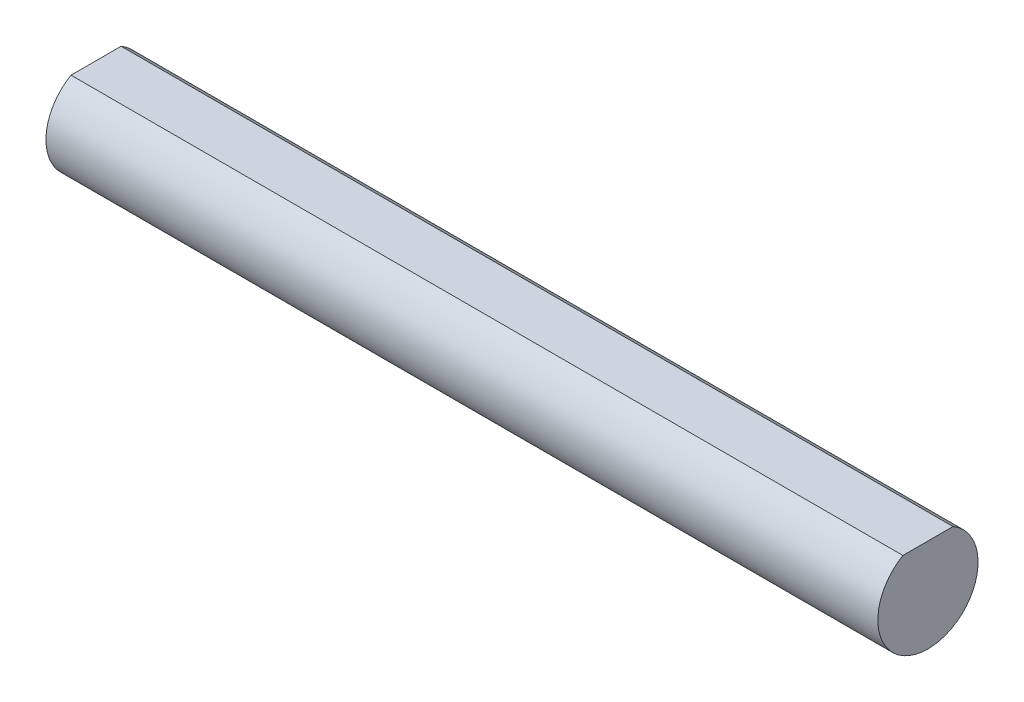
ISO-10303-21;
HEADER;
FILE_DESCRIPTION(('STEP AP214'),'2;1');
FILE_NAME('part.step','',(''),(''),'','','');
FILE_SCHEMA(('AUTOMOTIVE_DESIGN { 1 0 10303 214 1 1 1 1 }'));
ENDSEC;
DATA;
#1=APPLICATION_CONTEXT('core data for automotive mechanical design processes');
#2=APPLICATION_PROTOCOL_DEFINITION('international standard','automotive_design',2000,#1);
#3=PRODUCT_CONTEXT('',#1,'mechanical');
#4=PRODUCT('Part','Part','',(#3));
#5=PRODUCT_RELATED_PRODUCT_CATEGORY('part','',(#4));
#6=PRODUCT_DEFINITION_FORMATION('','',#4);
#7=PRODUCT_DEFINITION_CONTEXT('part definition',#1,'design');
#8=PRODUCT_DEFINITION('design','',#6,#7);
#9=PRODUCT_DEFINITION_SHAPE('','',#8);
#10=(LENGTH_UNIT() NAMED_UNIT(*) SI_UNIT(.MILLI.,.METRE.));
#11=(NAMED_UNIT(*) PLANE_ANGLE_UNIT() SI_UNIT($,.RADIAN.));
#12=(NAMED_UNIT(*) SI_UNIT($,.STERADIAN.) SOLID_ANGLE_UNIT());
#13=UNCERTAINTY_MEASURE_WITH_UNIT(LENGTH_MEASURE(1.E-05),#10,'distance_accuracy_value','');
#14=(GEOMETRIC_REPRESENTATION_CONTEXT(3) GLOBAL_UNCERTAINTY_ASSIGNED_CONTEXT((#13)) GLOBAL_UNIT_ASSIGNED_CONTEXT((#10,
#11,#12)) REPRESENTATION_CONTEXT('',''));
#15=CARTESIAN_POINT('',(0.,0.,0.));
#16=DIRECTION('',(0.,0.,1.));
#17=DIRECTION('',(1.,0.,0.));
#18=AXIS2_PLACEMENT_3D('',#15,#16,#17);
#19=CARTESIAN_POINT('',(49.8,0.,0.));
#20=DIRECTION('',(-1.,0.,0.));
#21=DIRECTION('',(0.,0.,1.));
#22=AXIS2_PLACEMENT_3D('',#19,#20,#21);
#23=CYLINDRICAL_SURFACE('',#22,3.);
#24=CARTESIAN_POINT('',(0.,0.,0.));
#25=DIRECTION('',(1.,0.,0.));
#26=DIRECTION('',(0.,0.,-1.));
#27=AXIS2_PLACEMENT_3D('',#24,#25,#26);
#28=CIRCLE('',#27,3.);
#29=CARTESIAN_POINT('',(0.,2.59807621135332,1.5));
#30=VERTEX_POINT('',#29);
#31=CARTESIAN_POINT('',(0.,2.59807621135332,-1.5));
#32=VERTEX_POINT('',#31);
#33=EDGE_CURVE('E67',#30,#32,#28,.T.);
#34=ORIENTED_EDGE('',*,*,#33,.T.);
#35=DIRECTION('',(-1.,0.,0.));
#36=VECTOR('',#35,1.);
#37=CARTESIAN_POINT('',(49.8,2.59807621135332,-1.5));
#38=LINE('',#37,#36);
#39=CARTESIAN_POINT('',(49.8,2.59807621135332,-1.5));
#40=VERTEX_POINT('',#39);
#41=EDGE_CURVE('E11',#40,#32,#38,.T.);
#42=ORIENTED_EDGE('',*,*,#41,.F.);
#43=CARTESIAN_POINT('',(49.8,0.,0.));
#44=DIRECTION('',(1.,0.,0.));
#45=DIRECTION('',(0.,0.,-1.));
#46=AXIS2_PLACEMENT_3D('',#43,#44,#45);
#47=CIRCLE('',#46,3.);
#48=CARTESIAN_POINT('',(49.8,2.59807621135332,1.5));
#49=VERTEX_POINT('',#48);
#50=EDGE_CURVE('E66',#49,#40,#47,.T.);
#51=ORIENTED_EDGE('',*,*,#50,.F.);
#52=DIRECTION('',(-1.,0.,0.));
#53=VECTOR('',#52,1.);
#54=CARTESIAN_POINT('',(49.8,2.59807621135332,1.5));
#55=LINE('',#54,#53);
#56=EDGE_CURVE('E44',#49,#30,#55,.T.);
#57=ORIENTED_EDGE('',*,*,#56,.T.);
#58=EDGE_LOOP('',(#34,#42,#51,#57));
#59=FACE_BOUND('',#58,.T.);
#60=ADVANCED_FACE('F36',(#59),#23,.T.);
#61=CARTESIAN_POINT('',(49.8,2.59807621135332,-1.5));
#62=DIRECTION('',(0.,-1.,0.));
#63=DIRECTION('',(0.,0.,-1.));
#64=AXIS2_PLACEMENT_3D('',#61,#62,#63);
#65=PLANE('',#64);
#66=DIRECTION('',(0.,0.,1.));
#67=VECTOR('',#66,1.);
#68=CARTESIAN_POINT('',(0.,2.59807621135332,-1.5));
#69=LINE('',#68,#67);
#70=EDGE_CURVE('E59',#32,#30,#69,.T.);
#71=ORIENTED_EDGE('',*,*,#70,.T.);
#72=ORIENTED_EDGE('',*,*,#56,.F.);
#73=DIRECTION('',(0.,0.,1.));
#74=VECTOR('',#73,1.);
#75=CARTESIAN_POINT('',(49.8,2.59807621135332,-1.5));
#76=LINE('',#75,#74);
#77=EDGE_CURVE('E51',#40,#49,#76,.T.);
#78=ORIENTED_EDGE('',*,*,#77,.F.);
#79=ORIENTED_EDGE('',*,*,#41,.T.);
#80=EDGE_LOOP('',(#71,#72,#78,#79));
#81=FACE_BOUND('',#80,.T.);
#82=ADVANCED_FACE('F62',(#81),#65,.F.);
#83=CARTESIAN_POINT('',(49.8,0.,0.));
#84=DIRECTION('',(1.,0.,0.));
#85=DIRECTION('',(0.,0.,-1.));
#86=AXIS2_PLACEMENT_3D('',#83,#84,#85);
#87=PLANE('',#86);
#88=ORIENTED_EDGE('',*,*,#50,.T.);
#89=ORIENTED_EDGE('',*,*,#77,.T.);
#90=EDGE_LOOP('',(#88,#89));
#91=FACE_BOUND('',#90,.T.);
#92=ADVANCED_FACE('F74',(#91),#87,.T.);
#93=CARTESIAN_POINT('',(0.,0.,0.));
#94=DIRECTION('',(1.,0.,0.));
#95=DIRECTION('',(0.,0.,-1.));
#96=AXIS2_PLACEMENT_3D('',#93,#94,#95);
#97=PLANE('',#96);
#98=ORIENTED_EDGE('',*,*,#33,.F.);
#99=ORIENTED_EDGE('',*,*,#70,.F.);
#100=EDGE_LOOP('',(#98,#99));
#101=FACE_BOUND('',#100,.T.);
#102=ADVANCED_FACE('F70',(#101),#97,.F.);
#103=CLOSED_SHELL('',(#60,#82,#92,#102));
#104=MANIFOLD_SOLID_BREP('B2',#103);
#105=ADVANCED_BREP_SHAPE_REPRESENTATION('',(#18,#104),#14);
#106=SHAPE_DEFINITION_REPRESENTATION(#9,#105);
ENDSEC;
END-ISO-10303-21;
